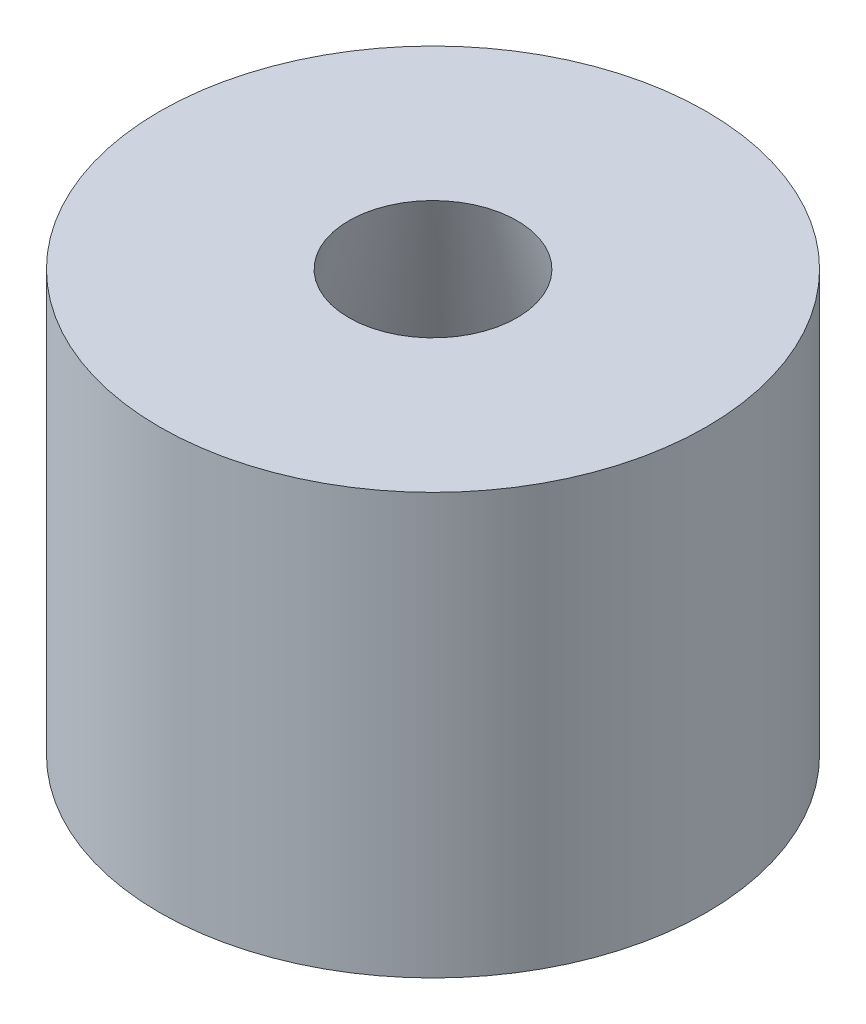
ISO-10303-21;
HEADER;
FILE_DESCRIPTION(('STEP AP214'),'2;1');
FILE_NAME('part.step','',(''),(''),'','','');
FILE_SCHEMA(('AUTOMOTIVE_DESIGN { 1 0 10303 214 1 1 1 1 }'));
ENDSEC;
DATA;
#1=APPLICATION_CONTEXT('core data for automotive mechanical design processes');
#2=APPLICATION_PROTOCOL_DEFINITION('international standard','automotive_design',2000,#1);
#3=PRODUCT_CONTEXT('',#1,'mechanical');
#4=PRODUCT('Part','Part','',(#3));
#5=PRODUCT_RELATED_PRODUCT_CATEGORY('part','',(#4));
#6=PRODUCT_DEFINITION_FORMATION('','',#4);
#7=PRODUCT_DEFINITION_CONTEXT('part definition',#1,'design');
#8=PRODUCT_DEFINITION('design','',#6,#7);
#9=PRODUCT_DEFINITION_SHAPE('','',#8);
#10=(LENGTH_UNIT() NAMED_UNIT(*) SI_UNIT(.MILLI.,.METRE.));
#11=(NAMED_UNIT(*) PLANE_ANGLE_UNIT() SI_UNIT($,.RADIAN.));
#12=(NAMED_UNIT(*) SI_UNIT($,.STERADIAN.) SOLID_ANGLE_UNIT());
#13=UNCERTAINTY_MEASURE_WITH_UNIT(LENGTH_MEASURE(1.E-05),#10,'distance_accuracy_value','');
#14=(GEOMETRIC_REPRESENTATION_CONTEXT(3) GLOBAL_UNCERTAINTY_ASSIGNED_CONTEXT((#13)) GLOBAL_UNIT_ASSIGNED_CONTEXT((#10,
#11,#12)) REPRESENTATION_CONTEXT('',''));
#15=CARTESIAN_POINT('',(0.,0.,0.));
#16=DIRECTION('',(0.,0.,1.));
#17=DIRECTION('',(1.,0.,0.));
#18=AXIS2_PLACEMENT_3D('',#15,#16,#17);
#19=CARTESIAN_POINT('',(0.,-63.5,0.));
#20=DIRECTION('',(0.,-1.,0.));
#21=DIRECTION('',(0.,0.,-1.));
#22=AXIS2_PLACEMENT_3D('',#19,#20,#21);
#23=CONICAL_SURFACE('',#22,31.75,0.291456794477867);
#24=CARTESIAN_POINT('',(0.,0.,0.));
#25=DIRECTION('',(0.,1.,0.));
#26=DIRECTION('',(0.,0.,1.));
#27=AXIS2_PLACEMENT_3D('',#24,#25,#26);
#28=CIRCLE('',#27,12.7);
#29=CARTESIAN_POINT('',(0.,0.,12.7));
#30=VERTEX_POINT('',#29);
#31=EDGE_CURVE('E10',#30,#30,#28,.T.);
#32=ORIENTED_EDGE('',*,*,#31,.T.);
#33=EDGE_LOOP('',(#32));
#34=FACE_BOUND('',#33,.T.);
#35=CARTESIAN_POINT('',(0.,-63.5,0.));
#36=DIRECTION('',(0.,1.,0.));
#37=DIRECTION('',(0.,0.,1.));
#38=AXIS2_PLACEMENT_3D('',#35,#36,#37);
#39=CIRCLE('',#38,31.75);
#40=CARTESIAN_POINT('',(0.,-63.5,31.75));
#41=VERTEX_POINT('',#40);
#42=EDGE_CURVE('E47',#41,#41,#39,.T.);
#43=ORIENTED_EDGE('',*,*,#42,.F.);
#44=EDGE_LOOP('',(#43));
#45=FACE_BOUND('',#44,.T.);
#46=ADVANCED_FACE('F33',(#34,#45),#23,.F.);
#47=CARTESIAN_POINT('',(12.7,0.,0.));
#48=DIRECTION('',(0.,1.,0.));
#49=DIRECTION('',(0.,0.,1.));
#50=AXIS2_PLACEMENT_3D('',#47,#48,#49);
#51=PLANE('',#50);
#52=CARTESIAN_POINT('',(0.,0.,0.));
#53=DIRECTION('',(0.,1.,0.));
#54=DIRECTION('',(0.,0.,1.));
#55=AXIS2_PLACEMENT_3D('',#52,#53,#54);
#56=CIRCLE('',#55,41.275);
#57=CARTESIAN_POINT('',(0.,0.,41.275));
#58=VERTEX_POINT('',#57);
#59=EDGE_CURVE('E39',#58,#58,#56,.T.);
#60=ORIENTED_EDGE('',*,*,#59,.T.);
#61=EDGE_LOOP('',(#60));
#62=FACE_BOUND('',#61,.T.);
#63=ORIENTED_EDGE('',*,*,#31,.F.);
#64=EDGE_LOOP('',(#63));
#65=FACE_BOUND('',#64,.T.);
#66=ADVANCED_FACE('F57',(#62,#65),#51,.T.);
#67=CARTESIAN_POINT('',(0.,44.9507886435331,0.));
#68=DIRECTION('',(0.,1.,0.));
#69=DIRECTION('',(0.,0.,1.));
#70=AXIS2_PLACEMENT_3D('',#67,#68,#69);
#71=CYLINDRICAL_SURFACE('',#70,41.275);
#72=CARTESIAN_POINT('',(0.,-63.5,0.));
#73=DIRECTION('',(0.,1.,0.));
#74=DIRECTION('',(0.,0.,1.));
#75=AXIS2_PLACEMENT_3D('',#72,#73,#74);
#76=CIRCLE('',#75,41.275);
#77=CARTESIAN_POINT('',(0.,-63.5,41.275));
#78=VERTEX_POINT('',#77);
#79=EDGE_CURVE('E43',#78,#78,#76,.T.);
#80=ORIENTED_EDGE('',*,*,#79,.T.);
#81=EDGE_LOOP('',(#80));
#82=FACE_BOUND('',#81,.T.);
#83=ORIENTED_EDGE('',*,*,#59,.F.);
#84=EDGE_LOOP('',(#83));
#85=FACE_BOUND('',#84,.T.);
#86=ADVANCED_FACE('F61',(#82,#85),#71,.T.);
#87=CARTESIAN_POINT('',(41.275,-63.5,0.));
#88=DIRECTION('',(0.,-1.,0.));
#89=DIRECTION('',(0.,0.,-1.));
#90=AXIS2_PLACEMENT_3D('',#87,#88,#89);
#91=PLANE('',#90);
#92=ORIENTED_EDGE('',*,*,#42,.T.);
#93=EDGE_LOOP('',(#92));
#94=FACE_BOUND('',#93,.T.);
#95=ORIENTED_EDGE('',*,*,#79,.F.);
#96=EDGE_LOOP('',(#95));
#97=FACE_BOUND('',#96,.T.);
#98=ADVANCED_FACE('F53',(#94,#97),#91,.T.);
#99=CLOSED_SHELL('',(#46,#66,#86,#98));
#100=MANIFOLD_SOLID_BREP('B2',#99);
#101=ADVANCED_BREP_SHAPE_REPRESENTATION('',(#18,#100),#14);
#102=SHAPE_DEFINITION_REPRESENTATION(#9,#101);
ENDSEC;
END-ISO-10303-21;
